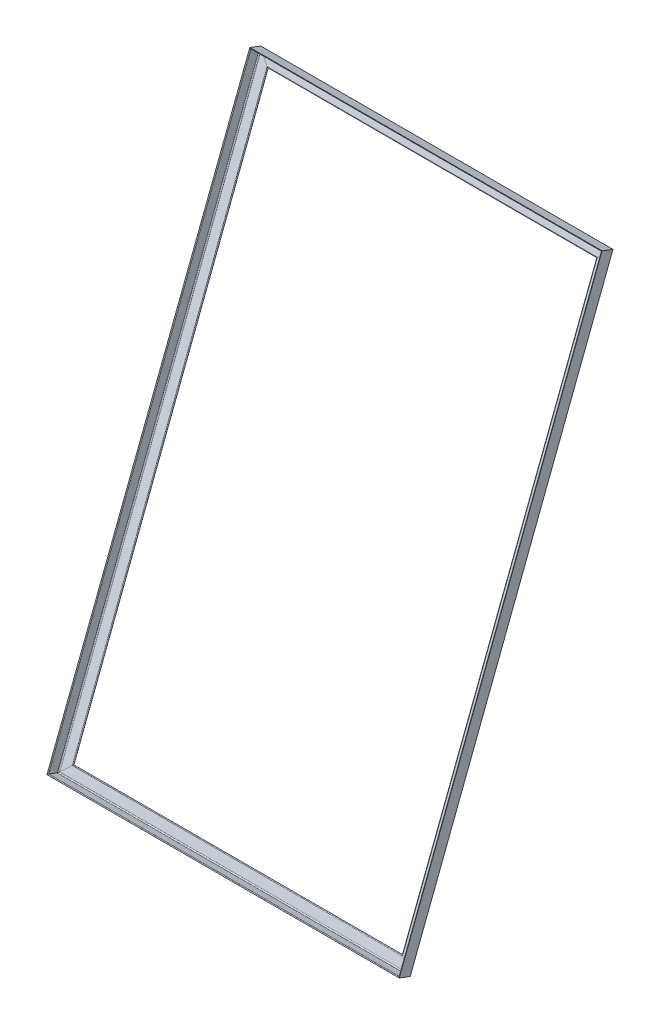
ISO-10303-21;
HEADER;
FILE_DESCRIPTION(('STEP AP214'),'2;1');
FILE_NAME('part.step','',(''),(''),'','','');
FILE_SCHEMA(('AUTOMOTIVE_DESIGN { 1 0 10303 214 1 1 1 1 }'));
ENDSEC;
DATA;
#1=APPLICATION_CONTEXT('core data for automotive mechanical design processes');
#2=APPLICATION_PROTOCOL_DEFINITION('international standard','automotive_design',2000,#1);
#3=PRODUCT_CONTEXT('',#1,'mechanical');
#4=PRODUCT('Part','Part','',(#3));
#5=PRODUCT_RELATED_PRODUCT_CATEGORY('part','',(#4));
#6=PRODUCT_DEFINITION_FORMATION('','',#4);
#7=PRODUCT_DEFINITION_CONTEXT('part definition',#1,'design');
#8=PRODUCT_DEFINITION('design','',#6,#7);
#9=PRODUCT_DEFINITION_SHAPE('','',#8);
#10=(LENGTH_UNIT() NAMED_UNIT(*) SI_UNIT(.MILLI.,.METRE.));
#11=(NAMED_UNIT(*) PLANE_ANGLE_UNIT() SI_UNIT($,.RADIAN.));
#12=(NAMED_UNIT(*) SI_UNIT($,.STERADIAN.) SOLID_ANGLE_UNIT());
#13=UNCERTAINTY_MEASURE_WITH_UNIT(LENGTH_MEASURE(1.E-05),#10,'distance_accuracy_value','');
#14=(GEOMETRIC_REPRESENTATION_CONTEXT(3) GLOBAL_UNCERTAINTY_ASSIGNED_CONTEXT((#13)) GLOBAL_UNIT_ASSIGNED_CONTEXT((#10,
#11,#12)) REPRESENTATION_CONTEXT('',''));
#15=CARTESIAN_POINT('',(0.,0.,0.));
#16=DIRECTION('',(0.,0.,1.));
#17=DIRECTION('',(1.,0.,0.));
#18=AXIS2_PLACEMENT_3D('',#15,#16,#17);
#19=CARTESIAN_POINT('',(50.8,2286.,877.519200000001));
#20=DIRECTION('',(0.,0.358370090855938,0.933579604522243));
#21=DIRECTION('',(0.,-0.933579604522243,0.358370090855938));
#22=AXIS2_PLACEMENT_3D('',#19,#20,#21);
#23=PLANE('',#22);
#24=DIRECTION('',(-0.707106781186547,0.660140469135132,-0.253405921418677));
#25=VECTOR('',#24,1.);
#26=CARTESIAN_POINT('',(1249.71980568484,3405.28707804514,447.862200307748));
#27=LINE('',#26,#25);
#28=CARTESIAN_POINT('',(50.7999999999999,4524.57415609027,18.2052006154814));
#29=VERTEX_POINT('',#28);
#30=CARTESIAN_POINT('',(0.,4572.,-6.10622663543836E-13));
#31=VERTEX_POINT('',#30);
#32=EDGE_CURVE('E154',#29,#31,#27,.T.);
#33=ORIENTED_EDGE('',*,*,#32,.F.);
#34=DIRECTION('',(0.,0.933579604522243,-0.358370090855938));
#35=VECTOR('',#34,1.);
#36=CARTESIAN_POINT('',(50.8,2286.,877.519200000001));
#37=LINE('',#36,#35);
#38=CARTESIAN_POINT('',(50.8000000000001,2333.42584390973,859.313999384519));
#39=VERTEX_POINT('',#38);
#40=EDGE_CURVE('E191',#39,#29,#37,.T.);
#41=ORIENTED_EDGE('',*,*,#40,.F.);
#42=DIRECTION('',(0.707106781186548,0.660140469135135,-0.253405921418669));
#43=VECTOR('',#42,1.);
#44=CARTESIAN_POINT('',(25.3999999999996,2309.71292195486,868.41659969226));
#45=LINE('',#44,#43);
#46=CARTESIAN_POINT('',(0.,2286.,877.5192));
#47=VERTEX_POINT('',#46);
#48=EDGE_CURVE('E145',#47,#39,#45,.T.);
#49=ORIENTED_EDGE('',*,*,#48,.F.);
#50=DIRECTION('',(0.,0.933579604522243,-0.358370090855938));
#51=VECTOR('',#50,1.);
#52=CARTESIAN_POINT('',(0.,2286.,877.519200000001));
#53=LINE('',#52,#51);
#54=EDGE_CURVE('E80',#47,#31,#53,.T.);
#55=ORIENTED_EDGE('',*,*,#54,.T.);
#56=EDGE_LOOP('',(#33,#41,#49,#55));
#57=FACE_BOUND('',#56,.T.);
#58=ADVANCED_FACE('F76',(#57),#23,.F.);
#59=CARTESIAN_POINT('',(50.8000000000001,2286.00182052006,877.523942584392));
#60=DIRECTION('',(-1.,0.,0.));
#61=DIRECTION('',(0.,0.,1.));
#62=AXIS2_PLACEMENT_3D('',#59,#60,#61);
#63=PLANE('',#62);
#64=DIRECTION('',(0.,-0.358370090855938,-0.933579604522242));
#65=VECTOR('',#64,1.);
#66=CARTESIAN_POINT('',(50.7999999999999,4524.57597661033,18.2099431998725));
#67=LINE('',#66,#65);
#68=CARTESIAN_POINT('',(50.7999999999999,4524.57597661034,18.2099431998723));
#69=VERTEX_POINT('',#68);
#70=EDGE_CURVE('E151',#69,#29,#67,.T.);
#71=ORIENTED_EDGE('',*,*,#70,.F.);
#72=DIRECTION('',(0.,0.933579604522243,-0.358370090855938));
#73=VECTOR('',#72,1.);
#74=CARTESIAN_POINT('',(50.8000000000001,2286.00182052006,877.523942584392));
#75=LINE('',#74,#73);
#76=CARTESIAN_POINT('',(50.8000000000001,2333.42766442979,859.31874196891));
#77=VERTEX_POINT('',#76);
#78=EDGE_CURVE('E189',#77,#69,#75,.T.);
#79=ORIENTED_EDGE('',*,*,#78,.F.);
#80=DIRECTION('',(0.,0.358370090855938,0.933579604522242));
#81=VECTOR('',#80,1.);
#82=CARTESIAN_POINT('',(50.8000000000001,2333.42766442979,859.31874196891));
#83=LINE('',#82,#81);
#84=EDGE_CURVE('E215',#39,#77,#83,.T.);
#85=ORIENTED_EDGE('',*,*,#84,.F.);
#86=ORIENTED_EDGE('',*,*,#40,.T.);
#87=EDGE_LOOP('',(#71,#79,#85,#86));
#88=FACE_BOUND('',#87,.T.);
#89=ADVANCED_FACE('F205',(#88),#63,.F.);
#90=CARTESIAN_POINT('',(47.6300800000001,2286.00182052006,877.523942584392));
#91=DIRECTION('',(0.,0.933579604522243,-0.358370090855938));
#92=DIRECTION('',(0.,0.358370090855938,0.933579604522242));
#93=AXIS2_PLACEMENT_3D('',#90,#91,#92);
#94=CYLINDRICAL_SURFACE('',#93,3.16991999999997);
#95=CARTESIAN_POINT('',(47.63008,4527.5353492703,17.0739386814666));
#96=DIRECTION('',(0.707106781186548,0.660140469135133,-0.253405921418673));
#97=DIRECTION('',(-0.707106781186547,0.660140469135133,-0.253405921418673));
#98=AXIS2_PLACEMENT_3D('',#95,#96,#97);
#99=ELLIPSE('',#98,4.48294385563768,3.16991999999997);
#100=CARTESIAN_POINT('',(47.6300800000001,4528.67135378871,20.0333113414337));
#101=VERTEX_POINT('',#100);
#102=EDGE_CURVE('E14',#101,#69,#99,.T.);
#103=ORIENTED_EDGE('',*,*,#102,.F.);
#104=DIRECTION('',(0.,0.933579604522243,-0.358370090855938));
#105=VECTOR('',#104,1.);
#106=CARTESIAN_POINT('',(47.6300800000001,2287.13782503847,880.483315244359));
#107=LINE('',#106,#105);
#108=CARTESIAN_POINT('',(47.6300799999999,2331.60429628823,863.414119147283));
#109=VERTEX_POINT('',#108);
#110=EDGE_CURVE('E186',#109,#101,#107,.T.);
#111=ORIENTED_EDGE('',*,*,#110,.F.);
#112=CARTESIAN_POINT('',(47.6300800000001,2330.46829176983,860.454746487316));
#113=DIRECTION('',(0.707106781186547,-0.660140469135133,0.253405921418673));
#114=DIRECTION('',(0.707106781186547,0.660140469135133,-0.253405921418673));
#115=AXIS2_PLACEMENT_3D('',#112,#113,#114);
#116=ELLIPSE('',#115,4.48294385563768,3.16991999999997);
#117=EDGE_CURVE('E212',#77,#109,#116,.T.);
#118=ORIENTED_EDGE('',*,*,#117,.F.);
#119=ORIENTED_EDGE('',*,*,#78,.T.);
#120=EDGE_LOOP('',(#103,#111,#118,#119));
#121=FACE_BOUND('',#120,.T.);
#122=ADVANCED_FACE('F209',(#121),#94,.T.);
#123=CARTESIAN_POINT('',(7.93750000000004,2287.13782503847,880.483315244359));
#124=DIRECTION('',(0.,-0.358370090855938,-0.933579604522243));
#125=DIRECTION('',(0.,0.933579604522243,-0.358370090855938));
#126=AXIS2_PLACEMENT_3D('',#123,#124,#125);
#127=PLANE('',#126);
#128=DIRECTION('',(0.707106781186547,-0.660140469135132,0.253405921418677));
#129=VECTOR('',#128,1.);
#130=CARTESIAN_POINT('',(1228.28855568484,3426.43268098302,443.14599654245));
#131=LINE('',#130,#129);
#132=CARTESIAN_POINT('',(7.9374999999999,4565.72753692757,5.80867784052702));
#133=VERTEX_POINT('',#132);
#134=EDGE_CURVE('E85',#133,#101,#131,.T.);
#135=ORIENTED_EDGE('',*,*,#134,.F.);
#136=DIRECTION('',(0.,0.933579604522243,-0.358370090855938));
#137=VECTOR('',#136,1.);
#138=CARTESIAN_POINT('',(7.93750000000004,2287.13782503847,880.483315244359));
#139=LINE('',#138,#137);
#140=CARTESIAN_POINT('',(7.93750000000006,2294.54811314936,877.638752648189));
#141=VERTEX_POINT('',#140);
#142=EDGE_CURVE('E183',#141,#133,#139,.T.);
#143=ORIENTED_EDGE('',*,*,#142,.F.);
#144=DIRECTION('',(-0.707106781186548,-0.660140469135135,0.253405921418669));
#145=VECTOR('',#144,1.);
#146=CARTESIAN_POINT('',(3.96874999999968,2290.84296909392,879.061033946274));
#147=LINE('',#146,#145);
#148=EDGE_CURVE('E214',#109,#141,#147,.T.);
#149=ORIENTED_EDGE('',*,*,#148,.F.);
#150=ORIENTED_EDGE('',*,*,#110,.T.);
#151=EDGE_LOOP('',(#135,#143,#149,#150));
#152=FACE_BOUND('',#151,.T.);
#153=ADVANCED_FACE('F256',(#152),#127,.F.);
#154=CARTESIAN_POINT('',(7.93750000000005,2288.84456259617,884.929488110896));
#155=DIRECTION('',(0.,0.933579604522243,-0.358370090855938));
#156=DIRECTION('',(0.,0.358370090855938,0.933579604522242));
#157=AXIS2_PLACEMENT_3D('',#154,#155,#156);
#158=CYLINDRICAL_SURFACE('',#157,4.76250000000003);
#159=CARTESIAN_POINT('',(7.93749999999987,4567.43427448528,10.2548507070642));
#160=DIRECTION('',(0.707106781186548,0.660140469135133,-0.253405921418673));
#161=DIRECTION('',(-0.707106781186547,0.660140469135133,-0.253405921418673));
#162=AXIS2_PLACEMENT_3D('',#159,#160,#161);
#163=ELLIPSE('',#162,6.73519209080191,4.76250000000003);
#164=CARTESIAN_POINT('',(3.17499999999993,4571.88044735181,8.54811314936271));
#165=VERTEX_POINT('',#164);
#166=EDGE_CURVE('E165',#165,#133,#163,.F.);
#167=ORIENTED_EDGE('',*,*,#166,.F.);
#168=DIRECTION('',(0.,0.933579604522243,-0.358370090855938));
#169=VECTOR('',#168,1.);
#170=CARTESIAN_POINT('',(3.17500000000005,2288.84456259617,884.929488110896));
#171=LINE('',#170,#169);
#172=CARTESIAN_POINT('',(3.17500000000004,2291.80867784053,883.791663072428));
#173=VERTEX_POINT('',#172);
#174=EDGE_CURVE('E180',#173,#165,#171,.T.);
#175=ORIENTED_EDGE('',*,*,#174,.F.);
#176=CARTESIAN_POINT('',(7.93750000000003,2296.25485070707,882.084925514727));
#177=DIRECTION('',(0.707106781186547,-0.660140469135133,0.253405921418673));
#178=DIRECTION('',(0.707106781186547,0.660140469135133,-0.253405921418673));
#179=AXIS2_PLACEMENT_3D('',#176,#177,#178);
#180=ELLIPSE('',#179,6.7351920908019,4.76250000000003);
#181=EDGE_CURVE('E217',#141,#173,#180,.F.);
#182=ORIENTED_EDGE('',*,*,#181,.F.);
#183=ORIENTED_EDGE('',*,*,#142,.T.);
#184=EDGE_LOOP('',(#167,#175,#182,#183));
#185=FACE_BOUND('',#184,.T.);
#186=ADVANCED_FACE('F230',(#185),#158,.F.);
#187=CARTESIAN_POINT('',(3.17499999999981,2303.06919609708,921.985671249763));
#188=DIRECTION('',(-1.,0.,0.));
#189=DIRECTION('',(0.,0.,1.));
#190=AXIS2_PLACEMENT_3D('',#187,#188,#189);
#191=PLANE('',#190);
#192=DIRECTION('',(0.,-0.358370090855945,-0.93357960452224));
#193=VECTOR('',#192,1.);
#194=CARTESIAN_POINT('',(3.17499999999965,4586.10508085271,45.6042962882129));
#195=LINE('',#194,#193);
#196=CARTESIAN_POINT('',(3.17499999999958,4586.10508085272,45.6042962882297));
#197=VERTEX_POINT('',#196);
#198=EDGE_CURVE('E168',#197,#165,#195,.T.);
#199=ORIENTED_EDGE('',*,*,#198,.F.);
#200=DIRECTION('',(0.,0.933579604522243,-0.358370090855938));
#201=VECTOR('',#200,1.);
#202=CARTESIAN_POINT('',(3.17499999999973,2303.06919609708,921.985671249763));
#203=LINE('',#202,#201);
#204=CARTESIAN_POINT('',(3.17499999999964,2306.03331134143,920.847846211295));
#205=VERTEX_POINT('',#204);
#206=EDGE_CURVE('E177',#205,#197,#203,.T.);
#207=ORIENTED_EDGE('',*,*,#206,.F.);
#208=DIRECTION('',(0.,0.358370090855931,0.933579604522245));
#209=VECTOR('',#208,1.);
#210=CARTESIAN_POINT('',(3.17499999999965,2306.03331134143,920.847846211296));
#211=LINE('',#210,#209);
#212=EDGE_CURVE('E156',#173,#205,#211,.T.);
#213=ORIENTED_EDGE('',*,*,#212,.F.);
#214=ORIENTED_EDGE('',*,*,#174,.T.);
#215=EDGE_LOOP('',(#199,#207,#213,#214));
#216=FACE_BOUND('',#215,.T.);
#217=ADVANCED_FACE('F227',(#216),#191,.F.);
#218=CARTESIAN_POINT('',(0.00507999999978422,2303.06919609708,921.985671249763));
#219=DIRECTION('',(0.,0.933579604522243,-0.358370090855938));
#220=DIRECTION('',(0.,0.358370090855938,0.933579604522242));
#221=AXIS2_PLACEMENT_3D('',#218,#219,#220);
#222=CYLINDRICAL_SURFACE('',#221,3.16991999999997);
#223=CARTESIAN_POINT('',(0.00507999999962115,4589.06445351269,44.4682917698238));
#224=DIRECTION('',(0.707106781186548,0.660140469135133,-0.253405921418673));
#225=DIRECTION('',(-0.707106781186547,0.660140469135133,-0.253405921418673));
#226=AXIS2_PLACEMENT_3D('',#223,#224,#225);
#227=ELLIPSE('',#226,4.48294385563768,3.16991999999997);
#228=CARTESIAN_POINT('',(0.00507999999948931,4590.20045803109,47.427664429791));
#229=VERTEX_POINT('',#228);
#230=EDGE_CURVE('E171',#229,#197,#227,.T.);
#231=ORIENTED_EDGE('',*,*,#230,.F.);
#232=DIRECTION('',(0.,0.933579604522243,-0.358370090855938));
#233=VECTOR('',#232,1.);
#234=CARTESIAN_POINT('',(0.00507999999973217,2304.20520061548,924.94504390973));
#235=LINE('',#234,#233);
#236=CARTESIAN_POINT('',(0.00507999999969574,2304.20994319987,924.943223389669));
#237=VERTEX_POINT('',#236);
#238=EDGE_CURVE('E139',#237,#229,#235,.T.);
#239=ORIENTED_EDGE('',*,*,#238,.F.);
#240=CARTESIAN_POINT('',(0.00507999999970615,2303.07393868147,921.983850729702));
#241=DIRECTION('',(0.707106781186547,-0.660140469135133,0.253405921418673));
#242=DIRECTION('',(0.707106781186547,0.660140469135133,-0.253405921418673));
#243=AXIS2_PLACEMENT_3D('',#240,#241,#242);
#244=ELLIPSE('',#243,4.48294385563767,3.16991999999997);
#245=EDGE_CURVE('E150',#205,#237,#244,.T.);
#246=ORIENTED_EDGE('',*,*,#245,.F.);
#247=ORIENTED_EDGE('',*,*,#206,.T.);
#248=EDGE_LOOP('',(#231,#239,#246,#247));
#249=FACE_BOUND('',#248,.T.);
#250=ADVANCED_FACE('F239',(#249),#222,.T.);
#251=CARTESIAN_POINT('',(-3.10515502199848E-13,2304.20520061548,924.94504390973));
#252=DIRECTION('',(0.,-0.358370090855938,-0.933579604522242));
#253=DIRECTION('',(0.,0.933579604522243,-0.358370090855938));
#254=AXIS2_PLACEMENT_3D('',#251,#252,#253);
#255=PLANE('',#254);
#256=DIRECTION('',(0.707106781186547,-0.660140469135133,0.253405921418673));
#257=VECTOR('',#256,1.);
#258=CARTESIAN_POINT('',(1224.31980568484,3447.20520061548,486.18544390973));
#259=LINE('',#258,#257);
#260=CARTESIAN_POINT('',(-4.35415592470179E-13,4590.20520061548,47.425843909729));
#261=VERTEX_POINT('',#260);
#262=EDGE_CURVE('E136',#261,#229,#259,.T.);
#263=ORIENTED_EDGE('',*,*,#262,.F.);
#264=DIRECTION('',(0.,0.933579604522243,-0.358370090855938));
#265=VECTOR('',#264,1.);
#266=CARTESIAN_POINT('',(-3.10515502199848E-13,2304.20520061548,924.94504390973));
#267=LINE('',#266,#265);
#268=CARTESIAN_POINT('',(-3.52148865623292E-13,2304.20520061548,924.94504390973));
#269=VERTEX_POINT('',#268);
#270=EDGE_CURVE('E93',#269,#261,#267,.T.);
#271=ORIENTED_EDGE('',*,*,#270,.F.);
#272=DIRECTION('',(-0.707106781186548,-0.660140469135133,0.253405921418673));
#273=VECTOR('',#272,1.);
#274=CARTESIAN_POINT('',(-5.06539254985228E-13,2304.20520061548,924.94504390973));
#275=LINE('',#274,#273);
#276=EDGE_CURVE('E133',#237,#269,#275,.T.);
#277=ORIENTED_EDGE('',*,*,#276,.F.);
#278=ORIENTED_EDGE('',*,*,#238,.T.);
#279=EDGE_LOOP('',(#263,#271,#277,#278));
#280=FACE_BOUND('',#279,.T.);
#281=ADVANCED_FACE('F130',(#280),#255,.F.);
#282=CARTESIAN_POINT('',(0.,2286.,877.519200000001));
#283=DIRECTION('',(1.,0.,0.));
#284=DIRECTION('',(0.,0.,-1.));
#285=AXIS2_PLACEMENT_3D('',#282,#283,#284);
#286=PLANE('',#285);
#287=DIRECTION('',(0.,0.358370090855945,0.93357960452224));
#288=VECTOR('',#287,1.);
#289=CARTESIAN_POINT('',(0.,4572.,-1.66533453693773E-11));
#290=LINE('',#289,#288);
#291=EDGE_CURVE('E161',#31,#261,#290,.T.);
#292=ORIENTED_EDGE('',*,*,#291,.F.);
#293=ORIENTED_EDGE('',*,*,#54,.F.);
#294=DIRECTION('',(0.,-0.358370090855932,-0.933579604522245));
#295=VECTOR('',#294,1.);
#296=CARTESIAN_POINT('',(0.,2286.,877.5192));
#297=LINE('',#296,#295);
#298=EDGE_CURVE('E138',#269,#47,#297,.T.);
#299=ORIENTED_EDGE('',*,*,#298,.F.);
#300=ORIENTED_EDGE('',*,*,#270,.T.);
#301=EDGE_LOOP('',(#292,#293,#299,#300));
#302=FACE_BOUND('',#301,.T.);
#303=ADVANCED_FACE('F142',(#302),#286,.F.);
#304=CARTESIAN_POINT('',(0.,2286.,877.519200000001));
#305=DIRECTION('',(0.707106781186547,-0.660140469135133,0.253405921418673));
#306=DIRECTION('',(0.68241445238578,0.730965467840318,0.));
#307=AXIS2_PLACEMENT_3D('',#304,#305,#306);
#308=PLANE('',#307);
#309=ORIENTED_EDGE('',*,*,#298,.T.);
#310=ORIENTED_EDGE('',*,*,#48,.T.);
#311=ORIENTED_EDGE('',*,*,#84,.T.);
#312=ORIENTED_EDGE('',*,*,#117,.T.);
#313=ORIENTED_EDGE('',*,*,#148,.T.);
#314=ORIENTED_EDGE('',*,*,#181,.T.);
#315=ORIENTED_EDGE('',*,*,#212,.T.);
#316=ORIENTED_EDGE('',*,*,#245,.T.);
#317=ORIENTED_EDGE('',*,*,#276,.T.);
#318=EDGE_LOOP('',(#309,#310,#311,#312,#313,#314,#315,#316,#317));
#319=FACE_BOUND('',#318,.T.);
#320=ADVANCED_FACE('F148',(#319),#308,.T.);
#321=CARTESIAN_POINT('',(0.,4572.,0.));
#322=DIRECTION('',(0.707106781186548,0.660140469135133,-0.253405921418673));
#323=DIRECTION('',(-0.68241445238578,0.730965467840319,0.));
#324=AXIS2_PLACEMENT_3D('',#321,#322,#323);
#325=PLANE('',#324);
#326=ORIENTED_EDGE('',*,*,#70,.T.);
#327=ORIENTED_EDGE('',*,*,#32,.T.);
#328=ORIENTED_EDGE('',*,*,#291,.T.);
#329=ORIENTED_EDGE('',*,*,#262,.T.);
#330=ORIENTED_EDGE('',*,*,#230,.T.);
#331=ORIENTED_EDGE('',*,*,#198,.T.);
#332=ORIENTED_EDGE('',*,*,#166,.T.);
#333=ORIENTED_EDGE('',*,*,#134,.T.);
#334=ORIENTED_EDGE('',*,*,#102,.T.);
#335=EDGE_LOOP('',(#326,#327,#328,#329,#330,#331,#332,#333,#334));
#336=FACE_BOUND('',#335,.T.);
#337=ADVANCED_FACE('F78',(#336),#325,.T.);
#338=CLOSED_SHELL('',(#58,#89,#122,#153,#186,#217,#250,#281,#303,#320,#337));
#339=MANIFOLD_SOLID_BREP('B2',#338);
#340=CARTESIAN_POINT('',(-1.55431223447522E-12,4524.57415609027,18.2052006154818));
#341=DIRECTION('',(0.,0.358370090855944,0.93357960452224));
#342=DIRECTION('',(0.,-0.933579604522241,0.358370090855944));
#343=AXIS2_PLACEMENT_3D('',#340,#341,#342);
#344=PLANE('',#343);
#345=DIRECTION('',(0.707106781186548,-0.660140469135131,0.253405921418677));
#346=VECTOR('',#345,1.);
#347=CARTESIAN_POINT('',(25.3999999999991,4548.28707804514,9.10260030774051));
#348=LINE('',#347,#346);
#349=CARTESIAN_POINT('',(0.,4572.,0.));
#350=VERTEX_POINT('',#349);
#351=CARTESIAN_POINT('',(50.8000000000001,4524.57415609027,18.2052006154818));
#352=VERTEX_POINT('',#351);
#353=EDGE_CURVE('E464',#350,#352,#348,.T.);
#354=ORIENTED_EDGE('',*,*,#353,.F.);
#355=DIRECTION('',(1.,0.,0.));
#356=VECTOR('',#355,1.);
#357=CARTESIAN_POINT('',(-1.55431223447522E-12,4572.,0.));
#358=LINE('',#357,#356);
#359=CARTESIAN_POINT('',(1524.,4572.,0.));
#360=VERTEX_POINT('',#359);
#361=EDGE_CURVE('E360',#350,#360,#358,.T.);
#362=ORIENTED_EDGE('',*,*,#361,.T.);
#363=DIRECTION('',(0.707106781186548,0.660140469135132,-0.253405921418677));
#364=VECTOR('',#363,1.);
#365=CARTESIAN_POINT('',(736.599999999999,3836.89941939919,282.18060953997));
#366=LINE('',#365,#364);
#367=CARTESIAN_POINT('',(1473.2,4524.57415609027,18.2052006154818));
#368=VERTEX_POINT('',#367);
#369=EDGE_CURVE('E485',#368,#360,#366,.T.);
#370=ORIENTED_EDGE('',*,*,#369,.F.);
#371=DIRECTION('',(1.,0.,0.));
#372=VECTOR('',#371,1.);
#373=CARTESIAN_POINT('',(-1.55431223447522E-12,4524.57415609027,18.2052006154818));
#374=LINE('',#373,#372);
#375=EDGE_CURVE('E479',#352,#368,#374,.T.);
#376=ORIENTED_EDGE('',*,*,#375,.F.);
#377=EDGE_LOOP('',(#354,#362,#370,#376));
#378=FACE_BOUND('',#377,.T.);
#379=ADVANCED_FACE('F356',(#378),#344,.F.);
#380=CARTESIAN_POINT('',(-6.66133814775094E-13,4524.57597661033,18.209943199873));
#381=DIRECTION('',(0.,0.933579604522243,-0.358370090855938));
#382=DIRECTION('',(0.,0.358370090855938,0.933579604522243));
#383=AXIS2_PLACEMENT_3D('',#380,#381,#382);
#384=PLANE('',#383);
#385=DIRECTION('',(0.,0.358370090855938,0.933579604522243));
#386=VECTOR('',#385,1.);
#387=CARTESIAN_POINT('',(50.8000000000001,4524.57597661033,18.209943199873));
#388=LINE('',#387,#386);
#389=CARTESIAN_POINT('',(50.8000000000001,4524.57597661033,18.209943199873));
#390=VERTEX_POINT('',#389);
#391=EDGE_CURVE('E419',#352,#390,#388,.T.);
#392=ORIENTED_EDGE('',*,*,#391,.F.);
#393=ORIENTED_EDGE('',*,*,#375,.T.);
#394=DIRECTION('',(0.,-0.358370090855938,-0.933579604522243));
#395=VECTOR('',#394,1.);
#396=CARTESIAN_POINT('',(1473.2,4524.57597661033,18.209943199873));
#397=LINE('',#396,#395);
#398=CARTESIAN_POINT('',(1473.2,4524.57597661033,18.209943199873));
#399=VERTEX_POINT('',#398);
#400=EDGE_CURVE('E471',#399,#368,#397,.T.);
#401=ORIENTED_EDGE('',*,*,#400,.F.);
#402=DIRECTION('',(1.,0.,0.));
#403=VECTOR('',#402,1.);
#404=CARTESIAN_POINT('',(-6.66133814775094E-13,4524.57597661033,18.209943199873));
#405=LINE('',#404,#403);
#406=EDGE_CURVE('E478',#390,#399,#405,.T.);
#407=ORIENTED_EDGE('',*,*,#406,.F.);
#408=EDGE_LOOP('',(#392,#393,#401,#407));
#409=FACE_BOUND('',#408,.T.);
#410=ADVANCED_FACE('F481',(#409),#384,.F.);
#411=CARTESIAN_POINT('',(-8.88178419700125E-13,4527.5353492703,17.0739386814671));
#412=DIRECTION('',(1.,0.,0.));
#413=DIRECTION('',(0.,0.,-1.));
#414=AXIS2_PLACEMENT_3D('',#411,#412,#413);
#415=CYLINDRICAL_SURFACE('',#414,3.16991999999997);
#416=CARTESIAN_POINT('',(47.6300800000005,4527.5353492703,17.0739386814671));
#417=DIRECTION('',(-0.707106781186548,-0.660140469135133,0.253405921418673));
#418=DIRECTION('',(0.707106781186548,-0.660140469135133,0.253405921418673));
#419=AXIS2_PLACEMENT_3D('',#416,#417,#418);
#420=ELLIPSE('',#419,4.48294385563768,3.16991999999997);
#421=CARTESIAN_POINT('',(47.6300799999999,4528.67135378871,20.0333113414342));
#422=VERTEX_POINT('',#421);
#423=EDGE_CURVE('E460',#390,#422,#420,.T.);
#424=ORIENTED_EDGE('',*,*,#423,.F.);
#425=ORIENTED_EDGE('',*,*,#406,.T.);
#426=CARTESIAN_POINT('',(1476.36992,4527.5353492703,17.0739386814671));
#427=DIRECTION('',(0.707106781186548,-0.660140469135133,0.253405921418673));
#428=DIRECTION('',(0.707106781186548,0.660140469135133,-0.253405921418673));
#429=AXIS2_PLACEMENT_3D('',#426,#427,#428);
#430=ELLIPSE('',#429,4.48294385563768,3.16991999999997);
#431=CARTESIAN_POINT('',(1476.36992,4528.67135378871,20.0333113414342));
#432=VERTEX_POINT('',#431);
#433=EDGE_CURVE('E469',#432,#399,#430,.T.);
#434=ORIENTED_EDGE('',*,*,#433,.F.);
#435=DIRECTION('',(1.,0.,0.));
#436=VECTOR('',#435,1.);
#437=CARTESIAN_POINT('',(-1.77635683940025E-12,4528.67135378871,20.0333113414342));
#438=LINE('',#437,#436);
#439=EDGE_CURVE('E476',#422,#432,#438,.T.);
#440=ORIENTED_EDGE('',*,*,#439,.F.);
#441=EDGE_LOOP('',(#424,#425,#434,#440));
#442=FACE_BOUND('',#441,.T.);
#443=ADVANCED_FACE('F522',(#442),#415,.T.);
#444=CARTESIAN_POINT('',(-1.77635683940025E-12,4565.72753692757,5.8086778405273));
#445=DIRECTION('',(0.,-0.358370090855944,-0.93357960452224));
#446=DIRECTION('',(0.,0.93357960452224,-0.358370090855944));
#447=AXIS2_PLACEMENT_3D('',#444,#445,#446);
#448=PLANE('',#447);
#449=DIRECTION('',(-0.707106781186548,0.660140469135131,-0.253405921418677));
#450=VECTOR('',#449,1.);
#451=CARTESIAN_POINT('',(3.96874999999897,4569.43268098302,4.3863965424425));
#452=LINE('',#451,#450);
#453=CARTESIAN_POINT('',(7.93749999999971,4565.72753692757,5.8086778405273));
#454=VERTEX_POINT('',#453);
#455=EDGE_CURVE('E456',#422,#454,#452,.T.);
#456=ORIENTED_EDGE('',*,*,#455,.F.);
#457=ORIENTED_EDGE('',*,*,#439,.T.);
#458=DIRECTION('',(-0.707106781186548,-0.660140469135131,0.253405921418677));
#459=VECTOR('',#458,1.);
#460=CARTESIAN_POINT('',(758.031249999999,3858.04502233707,277.464405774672));
#461=LINE('',#460,#459);
#462=CARTESIAN_POINT('',(1516.0625,4565.72753692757,5.8086778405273));
#463=VERTEX_POINT('',#462);
#464=EDGE_CURVE('E496',#463,#432,#461,.T.);
#465=ORIENTED_EDGE('',*,*,#464,.F.);
#466=DIRECTION('',(1.,0.,0.));
#467=VECTOR('',#466,1.);
#468=CARTESIAN_POINT('',(-1.77635683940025E-12,4565.72753692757,5.8086778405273));
#469=LINE('',#468,#467);
#470=EDGE_CURVE('E474',#454,#463,#469,.T.);
#471=ORIENTED_EDGE('',*,*,#470,.F.);
#472=EDGE_LOOP('',(#456,#457,#465,#471));
#473=FACE_BOUND('',#472,.T.);
#474=ADVANCED_FACE('F527',(#473),#448,.F.);
#475=CARTESIAN_POINT('',(-1.55431223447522E-12,4567.43427448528,10.2548507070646));
#476=DIRECTION('',(1.,0.,0.));
#477=DIRECTION('',(0.,0.,-1.));
#478=AXIS2_PLACEMENT_3D('',#475,#476,#477);
#479=CYLINDRICAL_SURFACE('',#478,4.76250000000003);
#480=CARTESIAN_POINT('',(7.9375000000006,4567.43427448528,10.2548507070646));
#481=DIRECTION('',(-0.707106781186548,-0.660140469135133,0.253405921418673));
#482=DIRECTION('',(0.707106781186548,-0.660140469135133,0.253405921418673));
#483=AXIS2_PLACEMENT_3D('',#480,#481,#482);
#484=ELLIPSE('',#483,6.7351920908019,4.76250000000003);
#485=CARTESIAN_POINT('',(3.17500000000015,4571.88044735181,8.54811314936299));
#486=VERTEX_POINT('',#485);
#487=EDGE_CURVE('E454',#454,#486,#484,.F.);
#488=ORIENTED_EDGE('',*,*,#487,.F.);
#489=ORIENTED_EDGE('',*,*,#470,.T.);
#490=CARTESIAN_POINT('',(1516.0625,4567.43427448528,10.2548507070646));
#491=DIRECTION('',(0.707106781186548,-0.660140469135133,0.253405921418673));
#492=DIRECTION('',(0.707106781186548,0.660140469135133,-0.253405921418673));
#493=AXIS2_PLACEMENT_3D('',#490,#491,#492);
#494=ELLIPSE('',#493,6.73519209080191,4.76250000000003);
#495=CARTESIAN_POINT('',(1520.825,4571.88044735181,8.54811314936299));
#496=VERTEX_POINT('',#495);
#497=EDGE_CURVE('E498',#496,#463,#494,.F.);
#498=ORIENTED_EDGE('',*,*,#497,.F.);
#499=DIRECTION('',(1.,0.,0.));
#500=VECTOR('',#499,1.);
#501=CARTESIAN_POINT('',(-1.77635683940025E-12,4571.88044735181,8.54811314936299));
#502=LINE('',#501,#500);
#503=EDGE_CURVE('E449',#486,#496,#502,.T.);
#504=ORIENTED_EDGE('',*,*,#503,.F.);
#505=EDGE_LOOP('',(#488,#489,#498,#504));
#506=FACE_BOUND('',#505,.T.);
#507=ADVANCED_FACE('F531',(#506),#479,.F.);
#508=CARTESIAN_POINT('',(-1.55431223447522E-12,4586.10508085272,45.6042962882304));
#509=DIRECTION('',(0.,0.93357960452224,-0.358370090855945));
#510=DIRECTION('',(0.,0.358370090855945,0.93357960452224));
#511=AXIS2_PLACEMENT_3D('',#508,#509,#510);
#512=PLANE('',#511);
#513=DIRECTION('',(0.,0.358370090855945,0.93357960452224));
#514=VECTOR('',#513,1.);
#515=CARTESIAN_POINT('',(3.17500000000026,4586.10508085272,45.6042962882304));
#516=LINE('',#515,#514);
#517=CARTESIAN_POINT('',(3.17500000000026,4586.10508085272,45.6042962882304));
#518=VERTEX_POINT('',#517);
#519=EDGE_CURVE('E441',#486,#518,#516,.T.);
#520=ORIENTED_EDGE('',*,*,#519,.F.);
#521=ORIENTED_EDGE('',*,*,#503,.T.);
#522=DIRECTION('',(0.,-0.358370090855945,-0.93357960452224));
#523=VECTOR('',#522,1.);
#524=CARTESIAN_POINT('',(1520.825,4586.10508085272,45.6042962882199));
#525=LINE('',#524,#523);
#526=CARTESIAN_POINT('',(1520.825,4586.10508085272,45.6042962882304));
#527=VERTEX_POINT('',#526);
#528=EDGE_CURVE('E447',#527,#496,#525,.T.);
#529=ORIENTED_EDGE('',*,*,#528,.F.);
#530=DIRECTION('',(1.,0.,0.));
#531=VECTOR('',#530,1.);
#532=CARTESIAN_POINT('',(-1.55431223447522E-12,4586.10508085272,45.6042962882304));
#533=LINE('',#532,#531);
#534=EDGE_CURVE('E436',#518,#527,#533,.T.);
#535=ORIENTED_EDGE('',*,*,#534,.F.);
#536=EDGE_LOOP('',(#520,#521,#529,#535));
#537=FACE_BOUND('',#536,.T.);
#538=ADVANCED_FACE('F444',(#537),#512,.F.);
#539=CARTESIAN_POINT('',(-1.66533453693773E-12,4589.06445351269,44.4682917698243));
#540=DIRECTION('',(1.,0.,0.));
#541=DIRECTION('',(0.,0.,-1.));
#542=AXIS2_PLACEMENT_3D('',#539,#540,#541);
#543=CYLINDRICAL_SURFACE('',#542,3.16991999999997);
#544=CARTESIAN_POINT('',(0.0050799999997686,4589.06445351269,44.4682917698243));
#545=DIRECTION('',(-0.707106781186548,-0.660140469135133,0.253405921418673));
#546=DIRECTION('',(0.707106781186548,-0.660140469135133,0.253405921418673));
#547=AXIS2_PLACEMENT_3D('',#544,#545,#546);
#548=ELLIPSE('',#547,4.48294385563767,3.16991999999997);
#549=CARTESIAN_POINT('',(0.00508000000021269,4590.20045803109,47.4276644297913));
#550=VERTEX_POINT('',#549);
#551=EDGE_CURVE('E365',#518,#550,#548,.T.);
#552=ORIENTED_EDGE('',*,*,#551,.F.);
#553=ORIENTED_EDGE('',*,*,#534,.T.);
#554=CARTESIAN_POINT('',(1523.99492,4589.06445351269,44.4682917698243));
#555=DIRECTION('',(0.707106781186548,-0.660140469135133,0.253405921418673));
#556=DIRECTION('',(0.707106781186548,0.660140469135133,-0.253405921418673));
#557=AXIS2_PLACEMENT_3D('',#554,#555,#556);
#558=ELLIPSE('',#557,4.48294385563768,3.16991999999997);
#559=CARTESIAN_POINT('',(1523.99492,4590.20045803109,47.4276644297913));
#560=VERTEX_POINT('',#559);
#561=EDGE_CURVE('E502',#560,#527,#558,.T.);
#562=ORIENTED_EDGE('',*,*,#561,.F.);
#563=DIRECTION('',(1.,0.,0.));
#564=VECTOR('',#563,1.);
#565=CARTESIAN_POINT('',(-1.55431223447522E-12,4590.20045803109,47.4276644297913));
#566=LINE('',#565,#564);
#567=EDGE_CURVE('E438',#550,#560,#566,.T.);
#568=ORIENTED_EDGE('',*,*,#567,.F.);
#569=EDGE_LOOP('',(#552,#553,#562,#568));
#570=FACE_BOUND('',#569,.T.);
#571=ADVANCED_FACE('F434',(#570),#543,.T.);
#572=CARTESIAN_POINT('',(-1.55431223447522E-12,4590.20520061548,47.4258439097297));
#573=DIRECTION('',(0.,-0.358370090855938,-0.933579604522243));
#574=DIRECTION('',(0.,0.933579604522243,-0.358370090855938));
#575=AXIS2_PLACEMENT_3D('',#572,#573,#574);
#576=PLANE('',#575);
#577=DIRECTION('',(-0.707106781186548,0.660140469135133,-0.253405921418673));
#578=VECTOR('',#577,1.);
#579=CARTESIAN_POINT('',(-7.7715611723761E-13,4590.20520061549,47.4258439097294));
#580=LINE('',#579,#578);
#581=CARTESIAN_POINT('',(-2.22044604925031E-13,4590.20520061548,47.4258439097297));
#582=VERTEX_POINT('',#581);
#583=EDGE_CURVE('E74',#550,#582,#580,.T.);
#584=ORIENTED_EDGE('',*,*,#583,.F.);
#585=ORIENTED_EDGE('',*,*,#567,.T.);
#586=DIRECTION('',(-0.707106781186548,-0.660140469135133,0.253405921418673));
#587=VECTOR('',#586,1.);
#588=CARTESIAN_POINT('',(761.999999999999,3878.81754196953,320.503853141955));
#589=LINE('',#588,#587);
#590=CARTESIAN_POINT('',(1524.,4590.20520061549,47.4258439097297));
#591=VERTEX_POINT('',#590);
#592=EDGE_CURVE('E504',#591,#560,#589,.T.);
#593=ORIENTED_EDGE('',*,*,#592,.F.);
#594=DIRECTION('',(1.,0.,0.));
#595=VECTOR('',#594,1.);
#596=CARTESIAN_POINT('',(-1.55431223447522E-12,4590.20520061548,47.4258439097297));
#597=LINE('',#596,#595);
#598=EDGE_CURVE('E378',#582,#591,#597,.T.);
#599=ORIENTED_EDGE('',*,*,#598,.F.);
#600=EDGE_LOOP('',(#584,#585,#593,#599));
#601=FACE_BOUND('',#600,.T.);
#602=ADVANCED_FACE('F509',(#601),#576,.F.);
#603=CARTESIAN_POINT('',(-1.55431223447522E-12,4572.,0.));
#604=DIRECTION('',(0.,-0.93357960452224,0.358370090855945));
#605=DIRECTION('',(0.,-0.358370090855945,-0.93357960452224));
#606=AXIS2_PLACEMENT_3D('',#603,#604,#605);
#607=PLANE('',#606);
#608=DIRECTION('',(0.,-0.358370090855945,-0.93357960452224));
#609=VECTOR('',#608,1.);
#610=CARTESIAN_POINT('',(0.,4572.,0.));
#611=LINE('',#610,#609);
#612=EDGE_CURVE('E467',#582,#350,#611,.T.);
#613=ORIENTED_EDGE('',*,*,#612,.F.);
#614=ORIENTED_EDGE('',*,*,#598,.T.);
#615=DIRECTION('',(0.,0.358370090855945,0.93357960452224));
#616=VECTOR('',#615,1.);
#617=CARTESIAN_POINT('',(1524.,4572.,-9.99547666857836E-12));
#618=LINE('',#617,#616);
#619=EDGE_CURVE('E488',#360,#591,#618,.T.);
#620=ORIENTED_EDGE('',*,*,#619,.F.);
#621=ORIENTED_EDGE('',*,*,#361,.F.);
#622=EDGE_LOOP('',(#613,#614,#620,#621));
#623=FACE_BOUND('',#622,.T.);
#624=ADVANCED_FACE('F507',(#623),#607,.F.);
#625=CARTESIAN_POINT('',(1524.,4572.,0.));
#626=DIRECTION('',(0.707106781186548,-0.660140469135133,0.253405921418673));
#627=DIRECTION('',(0.682414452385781,0.730965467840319,0.));
#628=AXIS2_PLACEMENT_3D('',#625,#626,#627);
#629=PLANE('',#628);
#630=ORIENTED_EDGE('',*,*,#400,.T.);
#631=ORIENTED_EDGE('',*,*,#369,.T.);
#632=ORIENTED_EDGE('',*,*,#619,.T.);
#633=ORIENTED_EDGE('',*,*,#592,.T.);
#634=ORIENTED_EDGE('',*,*,#561,.T.);
#635=ORIENTED_EDGE('',*,*,#528,.T.);
#636=ORIENTED_EDGE('',*,*,#497,.T.);
#637=ORIENTED_EDGE('',*,*,#464,.T.);
#638=ORIENTED_EDGE('',*,*,#433,.T.);
#639=EDGE_LOOP('',(#630,#631,#632,#633,#634,#635,#636,#637,#638));
#640=FACE_BOUND('',#639,.T.);
#641=ADVANCED_FACE('F490',(#640),#629,.T.);
#642=CARTESIAN_POINT('',(0.,4572.,0.));
#643=DIRECTION('',(-0.707106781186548,-0.660140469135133,0.253405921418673));
#644=DIRECTION('',(0.68241445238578,-0.730965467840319,0.));
#645=AXIS2_PLACEMENT_3D('',#642,#643,#644);
#646=PLANE('',#645);
#647=ORIENTED_EDGE('',*,*,#612,.T.);
#648=ORIENTED_EDGE('',*,*,#353,.T.);
#649=ORIENTED_EDGE('',*,*,#391,.T.);
#650=ORIENTED_EDGE('',*,*,#423,.T.);
#651=ORIENTED_EDGE('',*,*,#455,.T.);
#652=ORIENTED_EDGE('',*,*,#487,.T.);
#653=ORIENTED_EDGE('',*,*,#519,.T.);
#654=ORIENTED_EDGE('',*,*,#551,.T.);
#655=ORIENTED_EDGE('',*,*,#583,.T.);
#656=EDGE_LOOP('',(#647,#648,#649,#650,#651,#652,#653,#654,#655));
#657=FACE_BOUND('',#656,.T.);
#658=ADVANCED_FACE('F358',(#657),#646,.T.);
#659=CLOSED_SHELL('',(#379,#410,#443,#474,#507,#538,#571,#602,#624,#641,#658));
#660=MANIFOLD_SOLID_BREP('B8',#659);
#661=CARTESIAN_POINT('',(1524.,2333.42584390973,859.313999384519));
#662=DIRECTION('',(0.,0.358370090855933,0.933579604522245));
#663=DIRECTION('',(0.,-0.933579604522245,0.358370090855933));
#664=AXIS2_PLACEMENT_3D('',#661,#662,#663);
#665=PLANE('',#664);
#666=DIRECTION('',(-0.707106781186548,-0.660140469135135,0.253405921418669));
#667=VECTOR('',#666,1.);
#668=CARTESIAN_POINT('',(787.400000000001,3021.10058060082,595.338590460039));
#669=LINE('',#668,#667);
#670=CARTESIAN_POINT('',(50.7999999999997,2333.42584390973,859.313999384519));
#671=VERTEX_POINT('',#670);
#672=CARTESIAN_POINT('',(-4.44089209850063E-13,2286.,877.5192));
#673=VERTEX_POINT('',#672);
#674=EDGE_CURVE('E713',#671,#673,#669,.T.);
#675=ORIENTED_EDGE('',*,*,#674,.F.);
#676=DIRECTION('',(-1.,0.,0.));
#677=VECTOR('',#676,1.);
#678=CARTESIAN_POINT('',(1524.,2333.42584390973,859.313999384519));
#679=LINE('',#678,#677);
#680=CARTESIAN_POINT('',(1473.2,2333.42584390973,859.313999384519));
#681=VERTEX_POINT('',#680);
#682=EDGE_CURVE('E750',#681,#671,#679,.T.);
#683=ORIENTED_EDGE('',*,*,#682,.F.);
#684=DIRECTION('',(-0.707106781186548,0.660140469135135,-0.253405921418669));
#685=VECTOR('',#684,1.);
#686=CARTESIAN_POINT('',(1498.6,2309.71292195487,868.41659969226));
#687=LINE('',#686,#685);
#688=CARTESIAN_POINT('',(1524.,2286.,877.5192));
#689=VERTEX_POINT('',#688);
#690=EDGE_CURVE('E704',#689,#681,#687,.T.);
#691=ORIENTED_EDGE('',*,*,#690,.F.);
#692=DIRECTION('',(-1.,0.,0.));
#693=VECTOR('',#692,1.);
#694=CARTESIAN_POINT('',(1524.,2286.,877.5192));
#695=LINE('',#694,#693);
#696=EDGE_CURVE('E639',#689,#673,#695,.T.);
#697=ORIENTED_EDGE('',*,*,#696,.T.);
#698=EDGE_LOOP('',(#675,#683,#691,#697));
#699=FACE_BOUND('',#698,.T.);
#700=ADVANCED_FACE('F635',(#699),#665,.F.);
#701=CARTESIAN_POINT('',(1524.,2333.42766442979,859.31874196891));
#702=DIRECTION('',(0.,-0.933579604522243,0.358370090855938));
#703=DIRECTION('',(0.,-0.358370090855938,-0.933579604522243));
#704=AXIS2_PLACEMENT_3D('',#701,#702,#703);
#705=PLANE('',#704);
#706=DIRECTION('',(0.,-0.358370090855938,-0.933579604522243));
#707=VECTOR('',#706,1.);
#708=CARTESIAN_POINT('',(50.7999999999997,2333.42766442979,859.31874196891));
#709=LINE('',#708,#707);
#710=CARTESIAN_POINT('',(50.8,2333.42766442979,859.31874196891));
#711=VERTEX_POINT('',#710);
#712=EDGE_CURVE('E710',#711,#671,#709,.T.);
#713=ORIENTED_EDGE('',*,*,#712,.F.);
#714=DIRECTION('',(-1.,0.,0.));
#715=VECTOR('',#714,1.);
#716=CARTESIAN_POINT('',(1524.,2333.42766442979,859.31874196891));
#717=LINE('',#716,#715);
#718=CARTESIAN_POINT('',(1473.2,2333.42766442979,859.31874196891));
#719=VERTEX_POINT('',#718);
#720=EDGE_CURVE('E748',#719,#711,#717,.T.);
#721=ORIENTED_EDGE('',*,*,#720,.F.);
#722=DIRECTION('',(0.,0.358370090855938,0.933579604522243));
#723=VECTOR('',#722,1.);
#724=CARTESIAN_POINT('',(1473.2,2333.42766442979,859.31874196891));
#725=LINE('',#724,#723);
#726=EDGE_CURVE('E774',#681,#719,#725,.T.);
#727=ORIENTED_EDGE('',*,*,#726,.F.);
#728=ORIENTED_EDGE('',*,*,#682,.T.);
#729=EDGE_LOOP('',(#713,#721,#727,#728));
#730=FACE_BOUND('',#729,.T.);
#731=ADVANCED_FACE('F764',(#730),#705,.F.);
#732=CARTESIAN_POINT('',(1524.,2330.46829176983,860.454746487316));
#733=DIRECTION('',(-1.,0.,0.));
#734=DIRECTION('',(0.,0.,1.));
#735=AXIS2_PLACEMENT_3D('',#732,#733,#734);
#736=CYLINDRICAL_SURFACE('',#735,3.16991999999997);
#737=CARTESIAN_POINT('',(47.6300800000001,2330.46829176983,860.454746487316));
#738=DIRECTION('',(-0.707106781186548,0.660140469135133,-0.253405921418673));
#739=DIRECTION('',(-0.707106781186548,-0.660140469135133,0.253405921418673));
#740=AXIS2_PLACEMENT_3D('',#737,#738,#739);
#741=ELLIPSE('',#740,4.48294385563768,3.16991999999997);
#742=CARTESIAN_POINT('',(47.6300799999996,2331.60429628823,863.414119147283));
#743=VERTEX_POINT('',#742);
#744=EDGE_CURVE('E354',#743,#711,#741,.T.);
#745=ORIENTED_EDGE('',*,*,#744,.F.);
#746=DIRECTION('',(-1.,0.,0.));
#747=VECTOR('',#746,1.);
#748=CARTESIAN_POINT('',(1524.,2331.60429628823,863.414119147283));
#749=LINE('',#748,#747);
#750=CARTESIAN_POINT('',(1476.36992,2331.60429628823,863.414119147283));
#751=VERTEX_POINT('',#750);
#752=EDGE_CURVE('E745',#751,#743,#749,.T.);
#753=ORIENTED_EDGE('',*,*,#752,.F.);
#754=CARTESIAN_POINT('',(1476.36992,2330.46829176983,860.454746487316));
#755=DIRECTION('',(0.707106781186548,0.660140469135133,-0.253405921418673));
#756=DIRECTION('',(-0.707106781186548,0.660140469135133,-0.253405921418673));
#757=AXIS2_PLACEMENT_3D('',#754,#755,#756);
#758=ELLIPSE('',#757,4.48294385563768,3.16991999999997);
#759=EDGE_CURVE('E771',#719,#751,#758,.T.);
#760=ORIENTED_EDGE('',*,*,#759,.F.);
#761=ORIENTED_EDGE('',*,*,#720,.T.);
#762=EDGE_LOOP('',(#745,#753,#760,#761));
#763=FACE_BOUND('',#762,.T.);
#764=ADVANCED_FACE('F768',(#763),#736,.T.);
#765=CARTESIAN_POINT('',(1524.,2294.54811314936,877.638752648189));
#766=DIRECTION('',(0.,-0.358370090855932,-0.933579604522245));
#767=DIRECTION('',(0.,0.933579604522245,-0.358370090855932));
#768=AXIS2_PLACEMENT_3D('',#765,#766,#767);
#769=PLANE('',#768);
#770=DIRECTION('',(0.707106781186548,0.660140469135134,-0.253405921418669));
#771=VECTOR('',#770,1.);
#772=CARTESIAN_POINT('',(765.96875,3002.23062773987,605.983024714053));
#773=LINE('',#772,#771);
#774=CARTESIAN_POINT('',(7.93749999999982,2294.54811314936,877.638752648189));
#775=VERTEX_POINT('',#774);
#776=EDGE_CURVE('E644',#775,#743,#773,.T.);
#777=ORIENTED_EDGE('',*,*,#776,.F.);
#778=DIRECTION('',(-1.,0.,0.));
#779=VECTOR('',#778,1.);
#780=CARTESIAN_POINT('',(1524.,2294.54811314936,877.638752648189));
#781=LINE('',#780,#779);
#782=CARTESIAN_POINT('',(1516.0625,2294.54811314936,877.638752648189));
#783=VERTEX_POINT('',#782);
#784=EDGE_CURVE('E742',#783,#775,#781,.T.);
#785=ORIENTED_EDGE('',*,*,#784,.F.);
#786=DIRECTION('',(0.707106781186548,-0.660140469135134,0.253405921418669));
#787=VECTOR('',#786,1.);
#788=CARTESIAN_POINT('',(1520.03125,2290.84296909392,879.061033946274));
#789=LINE('',#788,#787);
#790=EDGE_CURVE('E773',#751,#783,#789,.T.);
#791=ORIENTED_EDGE('',*,*,#790,.F.);
#792=ORIENTED_EDGE('',*,*,#752,.T.);
#793=EDGE_LOOP('',(#777,#785,#791,#792));
#794=FACE_BOUND('',#793,.T.);
#795=ADVANCED_FACE('F815',(#794),#769,.F.);
#796=CARTESIAN_POINT('',(1524.,2296.25485070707,882.084925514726));
#797=DIRECTION('',(-1.,0.,0.));
#798=DIRECTION('',(0.,0.,1.));
#799=AXIS2_PLACEMENT_3D('',#796,#797,#798);
#800=CYLINDRICAL_SURFACE('',#799,4.76250000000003);
#801=CARTESIAN_POINT('',(7.9374999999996,2296.25485070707,882.084925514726));
#802=DIRECTION('',(-0.707106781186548,0.660140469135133,-0.253405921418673));
#803=DIRECTION('',(-0.707106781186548,-0.660140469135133,0.253405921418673));
#804=AXIS2_PLACEMENT_3D('',#801,#802,#803);
#805=ELLIPSE('',#804,6.73519209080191,4.76250000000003);
#806=CARTESIAN_POINT('',(3.17499999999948,2291.80867784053,883.791663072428));
#807=VERTEX_POINT('',#806);
#808=EDGE_CURVE('E724',#807,#775,#805,.F.);
#809=ORIENTED_EDGE('',*,*,#808,.F.);
#810=DIRECTION('',(-1.,0.,0.));
#811=VECTOR('',#810,1.);
#812=CARTESIAN_POINT('',(1524.,2291.80867784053,883.791663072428));
#813=LINE('',#812,#811);
#814=CARTESIAN_POINT('',(1520.825,2291.80867784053,883.791663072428));
#815=VERTEX_POINT('',#814);
#816=EDGE_CURVE('E739',#815,#807,#813,.T.);
#817=ORIENTED_EDGE('',*,*,#816,.F.);
#818=CARTESIAN_POINT('',(1516.0625,2296.25485070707,882.084925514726));
#819=DIRECTION('',(0.707106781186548,0.660140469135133,-0.253405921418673));
#820=DIRECTION('',(-0.707106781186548,0.660140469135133,-0.253405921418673));
#821=AXIS2_PLACEMENT_3D('',#818,#819,#820);
#822=ELLIPSE('',#821,6.73519209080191,4.76250000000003);
#823=EDGE_CURVE('E776',#783,#815,#822,.F.);
#824=ORIENTED_EDGE('',*,*,#823,.F.);
#825=ORIENTED_EDGE('',*,*,#784,.T.);
#826=EDGE_LOOP('',(#809,#817,#824,#825));
#827=FACE_BOUND('',#826,.T.);
#828=ADVANCED_FACE('F789',(#827),#800,.F.);
#829=CARTESIAN_POINT('',(1524.,2306.03331134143,920.847846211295));
#830=DIRECTION('',(0.,-0.933579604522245,0.358370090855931));
#831=DIRECTION('',(0.,-0.358370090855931,-0.933579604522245));
#832=AXIS2_PLACEMENT_3D('',#829,#830,#831);
#833=PLANE('',#832);
#834=DIRECTION('',(0.,-0.358370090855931,-0.933579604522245));
#835=VECTOR('',#834,1.);
#836=CARTESIAN_POINT('',(3.17499999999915,2306.03331134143,920.847846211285));
#837=LINE('',#836,#835);
#838=CARTESIAN_POINT('',(3.17499999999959,2306.03331134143,920.847846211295));
#839=VERTEX_POINT('',#838);
#840=EDGE_CURVE('E727',#839,#807,#837,.T.);
#841=ORIENTED_EDGE('',*,*,#840,.F.);
#842=DIRECTION('',(-1.,0.,0.));
#843=VECTOR('',#842,1.);
#844=CARTESIAN_POINT('',(1524.,2306.03331134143,920.847846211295));
#845=LINE('',#844,#843);
#846=CARTESIAN_POINT('',(1520.825,2306.03331134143,920.847846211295));
#847=VERTEX_POINT('',#846);
#848=EDGE_CURVE('E736',#847,#839,#845,.T.);
#849=ORIENTED_EDGE('',*,*,#848,.F.);
#850=DIRECTION('',(0.,0.358370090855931,0.933579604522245));
#851=VECTOR('',#850,1.);
#852=CARTESIAN_POINT('',(1520.825,2306.03331134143,920.847846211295));
#853=LINE('',#852,#851);
#854=EDGE_CURVE('E715',#815,#847,#853,.T.);
#855=ORIENTED_EDGE('',*,*,#854,.F.);
#856=ORIENTED_EDGE('',*,*,#816,.T.);
#857=EDGE_LOOP('',(#841,#849,#855,#856));
#858=FACE_BOUND('',#857,.T.);
#859=ADVANCED_FACE('F786',(#858),#833,.F.);
#860=CARTESIAN_POINT('',(1524.,2303.07393868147,921.983850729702));
#861=DIRECTION('',(-1.,0.,0.));
#862=DIRECTION('',(0.,0.,1.));
#863=AXIS2_PLACEMENT_3D('',#860,#861,#862);
#864=CYLINDRICAL_SURFACE('',#863,3.16991999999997);
#865=CARTESIAN_POINT('',(0.0050799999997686,2303.07393868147,921.983850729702));
#866=DIRECTION('',(-0.707106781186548,0.660140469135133,-0.253405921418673));
#867=DIRECTION('',(-0.707106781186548,-0.660140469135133,0.253405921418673));
#868=AXIS2_PLACEMENT_3D('',#865,#866,#867);
#869=ELLIPSE('',#868,4.48294385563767,3.16991999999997);
#870=CARTESIAN_POINT('',(0.00507999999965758,2304.20994319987,924.943223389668));
#871=VERTEX_POINT('',#870);
#872=EDGE_CURVE('E730',#871,#839,#869,.T.);
#873=ORIENTED_EDGE('',*,*,#872,.F.);
#874=DIRECTION('',(-1.,0.,0.));
#875=VECTOR('',#874,1.);
#876=CARTESIAN_POINT('',(1524.,2304.20994319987,924.943223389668));
#877=LINE('',#876,#875);
#878=CARTESIAN_POINT('',(1523.99492,2304.20994319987,924.943223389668));
#879=VERTEX_POINT('',#878);
#880=EDGE_CURVE('E698',#879,#871,#877,.T.);
#881=ORIENTED_EDGE('',*,*,#880,.F.);
#882=CARTESIAN_POINT('',(1523.99492,2303.07393868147,921.983850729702));
#883=DIRECTION('',(0.707106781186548,0.660140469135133,-0.253405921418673));
#884=DIRECTION('',(-0.707106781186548,0.660140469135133,-0.253405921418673));
#885=AXIS2_PLACEMENT_3D('',#882,#883,#884);
#886=ELLIPSE('',#885,4.48294385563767,3.16991999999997);
#887=EDGE_CURVE('E709',#847,#879,#886,.T.);
#888=ORIENTED_EDGE('',*,*,#887,.F.);
#889=ORIENTED_EDGE('',*,*,#848,.T.);
#890=EDGE_LOOP('',(#873,#881,#888,#889));
#891=FACE_BOUND('',#890,.T.);
#892=ADVANCED_FACE('F798',(#891),#864,.T.);
#893=CARTESIAN_POINT('',(1524.,2304.20520061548,924.94504390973));
#894=DIRECTION('',(0.,-0.358370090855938,-0.933579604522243));
#895=DIRECTION('',(0.,0.933579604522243,-0.358370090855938));
#896=AXIS2_PLACEMENT_3D('',#893,#894,#895);
#897=PLANE('',#896);
#898=DIRECTION('',(0.707106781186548,0.660140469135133,-0.253405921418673));
#899=VECTOR('',#898,1.);
#900=CARTESIAN_POINT('',(762.,3015.59285926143,651.867034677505));
#901=LINE('',#900,#899);
#902=CARTESIAN_POINT('',(-6.66133814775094E-13,2304.20520061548,924.94504390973));
#903=VERTEX_POINT('',#902);
#904=EDGE_CURVE('E695',#903,#871,#901,.T.);
#905=ORIENTED_EDGE('',*,*,#904,.F.);
#906=DIRECTION('',(-1.,0.,0.));
#907=VECTOR('',#906,1.);
#908=CARTESIAN_POINT('',(1524.,2304.20520061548,924.94504390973));
#909=LINE('',#908,#907);
#910=CARTESIAN_POINT('',(1524.,2304.20520061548,924.94504390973));
#911=VERTEX_POINT('',#910);
#912=EDGE_CURVE('E652',#911,#903,#909,.T.);
#913=ORIENTED_EDGE('',*,*,#912,.F.);
#914=DIRECTION('',(0.707106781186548,-0.660140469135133,0.253405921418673));
#915=VECTOR('',#914,1.);
#916=CARTESIAN_POINT('',(1524.,2304.20520061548,924.94504390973));
#917=LINE('',#916,#915);
#918=EDGE_CURVE('E692',#879,#911,#917,.T.);
#919=ORIENTED_EDGE('',*,*,#918,.F.);
#920=ORIENTED_EDGE('',*,*,#880,.T.);
#921=EDGE_LOOP('',(#905,#913,#919,#920));
#922=FACE_BOUND('',#921,.T.);
#923=ADVANCED_FACE('F689',(#922),#897,.F.);
#924=CARTESIAN_POINT('',(1524.,2286.,877.5192));
#925=DIRECTION('',(0.,0.933579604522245,-0.358370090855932));
#926=DIRECTION('',(0.,0.358370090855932,0.933579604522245));
#927=AXIS2_PLACEMENT_3D('',#924,#925,#926);
#928=PLANE('',#927);
#929=DIRECTION('',(0.,0.358370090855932,0.933579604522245));
#930=VECTOR('',#929,1.);
#931=CARTESIAN_POINT('',(-2.22044604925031E-13,2286.,877.51919999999));
#932=LINE('',#931,#930);
#933=EDGE_CURVE('E720',#673,#903,#932,.T.);
#934=ORIENTED_EDGE('',*,*,#933,.F.);
#935=ORIENTED_EDGE('',*,*,#696,.F.);
#936=DIRECTION('',(0.,-0.358370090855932,-0.933579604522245));
#937=VECTOR('',#936,1.);
#938=CARTESIAN_POINT('',(1524.,2286.,877.5192));
#939=LINE('',#938,#937);
#940=EDGE_CURVE('E697',#911,#689,#939,.T.);
#941=ORIENTED_EDGE('',*,*,#940,.F.);
#942=ORIENTED_EDGE('',*,*,#912,.T.);
#943=EDGE_LOOP('',(#934,#935,#941,#942));
#944=FACE_BOUND('',#943,.T.);
#945=ADVANCED_FACE('F701',(#944),#928,.F.);
#946=CARTESIAN_POINT('',(1524.,2286.,877.5192));
#947=DIRECTION('',(0.707106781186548,0.660140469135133,-0.253405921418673));
#948=DIRECTION('',(-0.68241445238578,0.730965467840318,0.));
#949=AXIS2_PLACEMENT_3D('',#946,#947,#948);
#950=PLANE('',#949);
#951=ORIENTED_EDGE('',*,*,#940,.T.);
#952=ORIENTED_EDGE('',*,*,#690,.T.);
#953=ORIENTED_EDGE('',*,*,#726,.T.);
#954=ORIENTED_EDGE('',*,*,#759,.T.);
#955=ORIENTED_EDGE('',*,*,#790,.T.);
#956=ORIENTED_EDGE('',*,*,#823,.T.);
#957=ORIENTED_EDGE('',*,*,#854,.T.);
#958=ORIENTED_EDGE('',*,*,#887,.T.);
#959=ORIENTED_EDGE('',*,*,#918,.T.);
#960=EDGE_LOOP('',(#951,#952,#953,#954,#955,#956,#957,#958,#959));
#961=FACE_BOUND('',#960,.T.);
#962=ADVANCED_FACE('F707',(#961),#950,.T.);
#963=CARTESIAN_POINT('',(0.,2286.,877.5192));
#964=DIRECTION('',(-0.707106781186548,0.660140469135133,-0.253405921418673));
#965=DIRECTION('',(-0.68241445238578,-0.730965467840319,0.));
#966=AXIS2_PLACEMENT_3D('',#963,#964,#965);
#967=PLANE('',#966);
#968=ORIENTED_EDGE('',*,*,#712,.T.);
#969=ORIENTED_EDGE('',*,*,#674,.T.);
#970=ORIENTED_EDGE('',*,*,#933,.T.);
#971=ORIENTED_EDGE('',*,*,#904,.T.);
#972=ORIENTED_EDGE('',*,*,#872,.T.);
#973=ORIENTED_EDGE('',*,*,#840,.T.);
#974=ORIENTED_EDGE('',*,*,#808,.T.);
#975=ORIENTED_EDGE('',*,*,#776,.T.);
#976=ORIENTED_EDGE('',*,*,#744,.T.);
#977=EDGE_LOOP('',(#968,#969,#970,#971,#972,#973,#974,#975,#976));
#978=FACE_BOUND('',#977,.T.);
#979=ADVANCED_FACE('F637',(#978),#967,.T.);
#980=CLOSED_SHELL('',(#700,#731,#764,#795,#828,#859,#892,#923,#945,#962,#979));
#981=MANIFOLD_SOLID_BREP('B68',#980);
#982=CARTESIAN_POINT('',(1473.2,4572.,0.));
#983=DIRECTION('',(0.,0.358370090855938,0.933579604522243));
#984=DIRECTION('',(0.,-0.933579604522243,0.358370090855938));
#985=AXIS2_PLACEMENT_3D('',#982,#983,#984);
#986=PLANE('',#985);
#987=DIRECTION('',(0.707106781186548,-0.660140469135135,0.253405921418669));
#988=VECTOR('',#987,1.);
#989=CARTESIAN_POINT('',(274.28019431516,3452.71292195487,429.656999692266));
#990=LINE('',#989,#988);
#991=CARTESIAN_POINT('',(1473.2,2333.42584390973,859.313999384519));
#992=VERTEX_POINT('',#991);
#993=CARTESIAN_POINT('',(1524.,2286.,877.519200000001));
#994=VERTEX_POINT('',#993);
#995=EDGE_CURVE('E983',#992,#994,#990,.T.);
#996=ORIENTED_EDGE('',*,*,#995,.F.);
#997=DIRECTION('',(0.,-0.933579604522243,0.358370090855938));
#998=VECTOR('',#997,1.);
#999=CARTESIAN_POINT('',(1473.2,4572.,0.));
#1000=LINE('',#999,#998);
#1001=CARTESIAN_POINT('',(1473.2,4524.57415609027,18.2052006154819));
#1002=VERTEX_POINT('',#1001);
#1003=EDGE_CURVE('E1020',#1002,#992,#1000,.T.);
#1004=ORIENTED_EDGE('',*,*,#1003,.F.);
#1005=DIRECTION('',(-0.707106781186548,-0.660140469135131,0.253405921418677));
#1006=VECTOR('',#1005,1.);
#1007=CARTESIAN_POINT('',(1498.6,4548.28707804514,9.10260030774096));
#1008=LINE('',#1007,#1006);
#1009=CARTESIAN_POINT('',(1524.,4572.,-1.11022302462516E-13));
#1010=VERTEX_POINT('',#1009);
#1011=EDGE_CURVE('E974',#1010,#1002,#1008,.T.);
#1012=ORIENTED_EDGE('',*,*,#1011,.F.);
#1013=DIRECTION('',(0.,-0.933579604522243,0.358370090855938));
#1014=VECTOR('',#1013,1.);
#1015=CARTESIAN_POINT('',(1524.,4572.,-3.88578058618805E-13));
#1016=LINE('',#1015,#1014);
#1017=EDGE_CURVE('E909',#1010,#994,#1016,.T.);
#1018=ORIENTED_EDGE('',*,*,#1017,.T.);
#1019=EDGE_LOOP('',(#996,#1004,#1012,#1018));
#1020=FACE_BOUND('',#1019,.T.);
#1021=ADVANCED_FACE('F905',(#1020),#986,.F.);
#1022=CARTESIAN_POINT('',(1473.2,4572.00182052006,0.00474258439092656));
#1023=DIRECTION('',(1.,0.,0.));
#1024=DIRECTION('',(0.,0.,-1.));
#1025=AXIS2_PLACEMENT_3D('',#1022,#1023,#1024);
#1026=PLANE('',#1025);
#1027=DIRECTION('',(0.,-0.358370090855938,-0.933579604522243));
#1028=VECTOR('',#1027,1.);
#1029=CARTESIAN_POINT('',(1473.2,2333.42766442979,859.31874196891));
#1030=LINE('',#1029,#1028);
#1031=CARTESIAN_POINT('',(1473.2,2333.42766442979,859.31874196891));
#1032=VERTEX_POINT('',#1031);
#1033=EDGE_CURVE('E980',#1032,#992,#1030,.T.);
#1034=ORIENTED_EDGE('',*,*,#1033,.F.);
#1035=DIRECTION('',(0.,-0.933579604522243,0.358370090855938));
#1036=VECTOR('',#1035,1.);
#1037=CARTESIAN_POINT('',(1473.2,4572.00182052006,0.00474258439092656));
#1038=LINE('',#1037,#1036);
#1039=CARTESIAN_POINT('',(1473.2,4524.57597661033,18.2099431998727));
#1040=VERTEX_POINT('',#1039);
#1041=EDGE_CURVE('E1018',#1040,#1032,#1038,.T.);
#1042=ORIENTED_EDGE('',*,*,#1041,.F.);
#1043=DIRECTION('',(0.,0.358370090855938,0.933579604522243));
#1044=VECTOR('',#1043,1.);
#1045=CARTESIAN_POINT('',(1473.2,4524.57597661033,18.2099431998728));
#1046=LINE('',#1045,#1044);
#1047=EDGE_CURVE('E1044',#1002,#1040,#1046,.T.);
#1048=ORIENTED_EDGE('',*,*,#1047,.F.);
#1049=ORIENTED_EDGE('',*,*,#1003,.T.);
#1050=EDGE_LOOP('',(#1034,#1042,#1048,#1049));
#1051=FACE_BOUND('',#1050,.T.);
#1052=ADVANCED_FACE('F1034',(#1051),#1026,.F.);
#1053=CARTESIAN_POINT('',(1476.36992,4572.00182052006,0.00474258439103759));
#1054=DIRECTION('',(0.,-0.933579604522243,0.358370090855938));
#1055=DIRECTION('',(0.,-0.358370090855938,-0.933579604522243));
#1056=AXIS2_PLACEMENT_3D('',#1053,#1054,#1055);
#1057=CYLINDRICAL_SURFACE('',#1056,3.16991999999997);
#1058=CARTESIAN_POINT('',(1476.36992,2330.46829176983,860.454746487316));
#1059=DIRECTION('',(-0.707106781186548,-0.660140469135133,0.253405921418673));
#1060=DIRECTION('',(0.707106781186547,-0.660140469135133,0.253405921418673));
#1061=AXIS2_PLACEMENT_3D('',#1058,#1059,#1060);
#1062=ELLIPSE('',#1061,4.48294385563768,3.16991999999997);
#1063=CARTESIAN_POINT('',(1476.36992,2331.60429628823,863.414119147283));
#1064=VERTEX_POINT('',#1063);
#1065=EDGE_CURVE('E633',#1064,#1032,#1062,.T.);
#1066=ORIENTED_EDGE('',*,*,#1065,.F.);
#1067=DIRECTION('',(0.,-0.933579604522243,0.358370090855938));
#1068=VECTOR('',#1067,1.);
#1069=CARTESIAN_POINT('',(1476.36992,4573.13782503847,2.96411524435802));
#1070=LINE('',#1069,#1068);
#1071=CARTESIAN_POINT('',(1476.36992,4528.67135378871,20.0333113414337));
#1072=VERTEX_POINT('',#1071);
#1073=EDGE_CURVE('E1015',#1072,#1064,#1070,.T.);
#1074=ORIENTED_EDGE('',*,*,#1073,.F.);
#1075=CARTESIAN_POINT('',(1476.36992,4527.5353492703,17.0739386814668));
#1076=DIRECTION('',(-0.707106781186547,0.660140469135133,-0.253405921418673));
#1077=DIRECTION('',(-0.707106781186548,-0.660140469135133,0.253405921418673));
#1078=AXIS2_PLACEMENT_3D('',#1075,#1076,#1077);
#1079=ELLIPSE('',#1078,4.48294385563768,3.16991999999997);
#1080=EDGE_CURVE('E1041',#1040,#1072,#1079,.T.);
#1081=ORIENTED_EDGE('',*,*,#1080,.F.);
#1082=ORIENTED_EDGE('',*,*,#1041,.T.);
#1083=EDGE_LOOP('',(#1066,#1074,#1081,#1082));
#1084=FACE_BOUND('',#1083,.T.);
#1085=ADVANCED_FACE('F1038',(#1084),#1057,.T.);
#1086=CARTESIAN_POINT('',(1516.0625,4573.13782503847,2.96411524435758));
#1087=DIRECTION('',(0.,-0.358370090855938,-0.933579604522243));
#1088=DIRECTION('',(0.,0.933579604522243,-0.358370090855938));
#1089=AXIS2_PLACEMENT_3D('',#1086,#1087,#1088);
#1090=PLANE('',#1089);
#1091=DIRECTION('',(-0.707106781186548,0.660140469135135,-0.253405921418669));
#1092=VECTOR('',#1091,1.);
#1093=CARTESIAN_POINT('',(295.711444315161,3433.84296909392,440.30143394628));
#1094=LINE('',#1093,#1092);
#1095=CARTESIAN_POINT('',(1516.0625,2294.54811314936,877.638752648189));
#1096=VERTEX_POINT('',#1095);
#1097=EDGE_CURVE('E914',#1096,#1064,#1094,.T.);
#1098=ORIENTED_EDGE('',*,*,#1097,.F.);
#1099=DIRECTION('',(0.,-0.933579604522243,0.358370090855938));
#1100=VECTOR('',#1099,1.);
#1101=CARTESIAN_POINT('',(1516.0625,4573.13782503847,2.96411524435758));
#1102=LINE('',#1101,#1100);
#1103=CARTESIAN_POINT('',(1516.0625,4565.72753692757,5.80867784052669));
#1104=VERTEX_POINT('',#1103);
#1105=EDGE_CURVE('E1012',#1104,#1096,#1102,.T.);
#1106=ORIENTED_EDGE('',*,*,#1105,.F.);
#1107=DIRECTION('',(0.707106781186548,0.660140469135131,-0.253405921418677));
#1108=VECTOR('',#1107,1.);
#1109=CARTESIAN_POINT('',(1520.03125,4569.43268098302,4.38639654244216));
#1110=LINE('',#1109,#1108);
#1111=EDGE_CURVE('E1043',#1072,#1104,#1110,.T.);
#1112=ORIENTED_EDGE('',*,*,#1111,.F.);
#1113=ORIENTED_EDGE('',*,*,#1073,.T.);
#1114=EDGE_LOOP('',(#1098,#1106,#1112,#1113));
#1115=FACE_BOUND('',#1114,.T.);
#1116=ADVANCED_FACE('F1085',(#1115),#1090,.F.);
#1117=CARTESIAN_POINT('',(1516.0625,4574.84456259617,7.41028811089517));
#1118=DIRECTION('',(0.,-0.933579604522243,0.358370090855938));
#1119=DIRECTION('',(0.,-0.358370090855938,-0.933579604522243));
#1120=AXIS2_PLACEMENT_3D('',#1117,#1118,#1119);
#1121=CYLINDRICAL_SURFACE('',#1120,4.76250000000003);
#1122=CARTESIAN_POINT('',(1516.0625,2296.25485070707,882.084925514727));
#1123=DIRECTION('',(-0.707106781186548,-0.660140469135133,0.253405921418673));
#1124=DIRECTION('',(0.707106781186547,-0.660140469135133,0.253405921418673));
#1125=AXIS2_PLACEMENT_3D('',#1122,#1123,#1124);
#1126=ELLIPSE('',#1125,6.73519209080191,4.76250000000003);
#1127=CARTESIAN_POINT('',(1520.825,2291.80867784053,883.791663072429));
#1128=VERTEX_POINT('',#1127);
#1129=EDGE_CURVE('E994',#1128,#1096,#1126,.F.);
#1130=ORIENTED_EDGE('',*,*,#1129,.F.);
#1131=DIRECTION('',(0.,-0.933579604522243,0.358370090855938));
#1132=VECTOR('',#1131,1.);
#1133=CARTESIAN_POINT('',(1520.825,4574.84456259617,7.41028811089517));
#1134=LINE('',#1133,#1132);
#1135=CARTESIAN_POINT('',(1520.825,4571.88044735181,8.54811314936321));
#1136=VERTEX_POINT('',#1135);
#1137=EDGE_CURVE('E1009',#1136,#1128,#1134,.T.);
#1138=ORIENTED_EDGE('',*,*,#1137,.F.);
#1139=CARTESIAN_POINT('',(1516.0625,4567.43427448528,10.2548507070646));
#1140=DIRECTION('',(-0.707106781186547,0.660140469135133,-0.253405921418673));
#1141=DIRECTION('',(-0.707106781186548,-0.660140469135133,0.253405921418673));
#1142=AXIS2_PLACEMENT_3D('',#1139,#1140,#1141);
#1143=ELLIPSE('',#1142,6.7351920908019,4.76250000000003);
#1144=EDGE_CURVE('E1046',#1104,#1136,#1143,.F.);
#1145=ORIENTED_EDGE('',*,*,#1144,.F.);
#1146=ORIENTED_EDGE('',*,*,#1105,.T.);
#1147=EDGE_LOOP('',(#1130,#1138,#1145,#1146));
#1148=FACE_BOUND('',#1147,.T.);
#1149=ADVANCED_FACE('F1059',(#1148),#1121,.F.);
#1150=CARTESIAN_POINT('',(1520.825,4589.06919609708,44.4664712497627));
#1151=DIRECTION('',(1.,0.,0.));
#1152=DIRECTION('',(0.,0.,-1.));
#1153=AXIS2_PLACEMENT_3D('',#1150,#1151,#1152);
#1154=PLANE('',#1153);
#1155=DIRECTION('',(0.,-0.358370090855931,-0.933579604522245));
#1156=VECTOR('',#1155,1.);
#1157=CARTESIAN_POINT('',(1520.825,2306.03331134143,920.847846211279));
#1158=LINE('',#1157,#1156);
#1159=CARTESIAN_POINT('',(1520.825,2306.03331134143,920.847846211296));
#1160=VERTEX_POINT('',#1159);
#1161=EDGE_CURVE('E997',#1160,#1128,#1158,.T.);
#1162=ORIENTED_EDGE('',*,*,#1161,.F.);
#1163=DIRECTION('',(0.,-0.933579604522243,0.358370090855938));
#1164=VECTOR('',#1163,1.);
#1165=CARTESIAN_POINT('',(1520.825,4589.06919609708,44.4664712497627));
#1166=LINE('',#1165,#1164);
#1167=CARTESIAN_POINT('',(1520.825,4586.10508085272,45.6042962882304));
#1168=VERTEX_POINT('',#1167);
#1169=EDGE_CURVE('E1006',#1168,#1160,#1166,.T.);
#1170=ORIENTED_EDGE('',*,*,#1169,.F.);
#1171=DIRECTION('',(0.,0.358370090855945,0.93357960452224));
#1172=VECTOR('',#1171,1.);
#1173=CARTESIAN_POINT('',(1520.825,4586.10508085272,45.6042962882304));
#1174=LINE('',#1173,#1172);
#1175=EDGE_CURVE('E985',#1136,#1168,#1174,.T.);
#1176=ORIENTED_EDGE('',*,*,#1175,.F.);
#1177=ORIENTED_EDGE('',*,*,#1137,.T.);
#1178=EDGE_LOOP('',(#1162,#1170,#1176,#1177));
#1179=FACE_BOUND('',#1178,.T.);
#1180=ADVANCED_FACE('F1056',(#1179),#1154,.F.);
#1181=CARTESIAN_POINT('',(1523.99492,4589.06919609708,44.4664712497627));
#1182=DIRECTION('',(0.,-0.933579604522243,0.358370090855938));
#1183=DIRECTION('',(0.,-0.358370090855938,-0.933579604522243));
#1184=AXIS2_PLACEMENT_3D('',#1181,#1182,#1183);
#1185=CYLINDRICAL_SURFACE('',#1184,3.16991999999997);
#1186=CARTESIAN_POINT('',(1523.99492,2303.07393868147,921.983850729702));
#1187=DIRECTION('',(-0.707106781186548,-0.660140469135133,0.253405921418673));
#1188=DIRECTION('',(0.707106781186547,-0.660140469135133,0.253405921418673));
#1189=AXIS2_PLACEMENT_3D('',#1186,#1187,#1188);
#1190=ELLIPSE('',#1189,4.48294385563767,3.16991999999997);
#1191=CARTESIAN_POINT('',(1523.99492,2304.20994319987,924.943223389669));
#1192=VERTEX_POINT('',#1191);
#1193=EDGE_CURVE('E1000',#1192,#1160,#1190,.T.);
#1194=ORIENTED_EDGE('',*,*,#1193,.F.);
#1195=DIRECTION('',(0.,-0.933579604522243,0.358370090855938));
#1196=VECTOR('',#1195,1.);
#1197=CARTESIAN_POINT('',(1523.99492,4590.20520061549,47.4258439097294));
#1198=LINE('',#1197,#1196);
#1199=CARTESIAN_POINT('',(1523.99492,4590.20045803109,47.4276644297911));
#1200=VERTEX_POINT('',#1199);
#1201=EDGE_CURVE('E968',#1200,#1192,#1198,.T.);
#1202=ORIENTED_EDGE('',*,*,#1201,.F.);
#1203=CARTESIAN_POINT('',(1523.99492,4589.06445351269,44.4682917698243));
#1204=DIRECTION('',(-0.707106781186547,0.660140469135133,-0.253405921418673));
#1205=DIRECTION('',(-0.707106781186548,-0.660140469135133,0.253405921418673));
#1206=AXIS2_PLACEMENT_3D('',#1203,#1204,#1205);
#1207=ELLIPSE('',#1206,4.48294385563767,3.16991999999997);
#1208=EDGE_CURVE('E979',#1168,#1200,#1207,.T.);
#1209=ORIENTED_EDGE('',*,*,#1208,.F.);
#1210=ORIENTED_EDGE('',*,*,#1169,.T.);
#1211=EDGE_LOOP('',(#1194,#1202,#1209,#1210));
#1212=FACE_BOUND('',#1211,.T.);
#1213=ADVANCED_FACE('F1068',(#1212),#1185,.T.);
#1214=CARTESIAN_POINT('',(1524.,4590.20520061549,47.4258439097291));
#1215=DIRECTION('',(0.,-0.358370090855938,-0.933579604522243));
#1216=DIRECTION('',(0.,0.933579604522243,-0.358370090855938));
#1217=AXIS2_PLACEMENT_3D('',#1214,#1215,#1216);
#1218=PLANE('',#1217);
#1219=DIRECTION('',(-0.707106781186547,0.660140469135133,-0.253405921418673));
#1220=VECTOR('',#1219,1.);
#1221=CARTESIAN_POINT('',(299.680194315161,3447.20520061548,486.185443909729));
#1222=LINE('',#1221,#1220);
#1223=CARTESIAN_POINT('',(1524.,2304.20520061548,924.94504390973));
#1224=VERTEX_POINT('',#1223);
#1225=EDGE_CURVE('E965',#1224,#1192,#1222,.T.);
#1226=ORIENTED_EDGE('',*,*,#1225,.F.);
#1227=DIRECTION('',(0.,-0.933579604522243,0.358370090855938));
#1228=VECTOR('',#1227,1.);
#1229=CARTESIAN_POINT('',(1524.,4590.20520061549,47.4258439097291));
#1230=LINE('',#1229,#1228);
#1231=CARTESIAN_POINT('',(1524.,4590.20520061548,47.4258439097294));
#1232=VERTEX_POINT('',#1231);
#1233=EDGE_CURVE('E922',#1232,#1224,#1230,.T.);
#1234=ORIENTED_EDGE('',*,*,#1233,.F.);
#1235=DIRECTION('',(0.707106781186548,0.660140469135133,-0.253405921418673));
#1236=VECTOR('',#1235,1.);
#1237=CARTESIAN_POINT('',(1524.,4590.20520061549,47.4258439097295));
#1238=LINE('',#1237,#1236);
#1239=EDGE_CURVE('E962',#1200,#1232,#1238,.T.);
#1240=ORIENTED_EDGE('',*,*,#1239,.F.);
#1241=ORIENTED_EDGE('',*,*,#1201,.T.);
#1242=EDGE_LOOP('',(#1226,#1234,#1240,#1241));
#1243=FACE_BOUND('',#1242,.T.);
#1244=ADVANCED_FACE('F959',(#1243),#1218,.F.);
#1245=CARTESIAN_POINT('',(1524.,4572.,-3.88578058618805E-13));
#1246=DIRECTION('',(-1.,0.,0.));
#1247=DIRECTION('',(0.,0.,1.));
#1248=AXIS2_PLACEMENT_3D('',#1245,#1246,#1247);
#1249=PLANE('',#1248);
#1250=DIRECTION('',(0.,0.358370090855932,0.933579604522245));
#1251=VECTOR('',#1250,1.);
#1252=CARTESIAN_POINT('',(1524.,2285.99999999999,877.519199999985));
#1253=LINE('',#1252,#1251);
#1254=EDGE_CURVE('E990',#994,#1224,#1253,.T.);
#1255=ORIENTED_EDGE('',*,*,#1254,.F.);
#1256=ORIENTED_EDGE('',*,*,#1017,.F.);
#1257=DIRECTION('',(0.,-0.358370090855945,-0.93357960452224));
#1258=VECTOR('',#1257,1.);
#1259=CARTESIAN_POINT('',(1524.,4572.,-1.11022302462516E-13));
#1260=LINE('',#1259,#1258);
#1261=EDGE_CURVE('E967',#1232,#1010,#1260,.T.);
#1262=ORIENTED_EDGE('',*,*,#1261,.F.);
#1263=ORIENTED_EDGE('',*,*,#1233,.T.);
#1264=EDGE_LOOP('',(#1255,#1256,#1262,#1263));
#1265=FACE_BOUND('',#1264,.T.);
#1266=ADVANCED_FACE('F971',(#1265),#1249,.F.);
#1267=CARTESIAN_POINT('',(1524.,4572.,-1.11022302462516E-13));
#1268=DIRECTION('',(-0.707106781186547,0.660140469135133,-0.253405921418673));
#1269=DIRECTION('',(-0.682414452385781,-0.730965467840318,0.));
#1270=AXIS2_PLACEMENT_3D('',#1267,#1268,#1269);
#1271=PLANE('',#1270);
#1272=ORIENTED_EDGE('',*,*,#1261,.T.);
#1273=ORIENTED_EDGE('',*,*,#1011,.T.);
#1274=ORIENTED_EDGE('',*,*,#1047,.T.);
#1275=ORIENTED_EDGE('',*,*,#1080,.T.);
#1276=ORIENTED_EDGE('',*,*,#1111,.T.);
#1277=ORIENTED_EDGE('',*,*,#1144,.T.);
#1278=ORIENTED_EDGE('',*,*,#1175,.T.);
#1279=ORIENTED_EDGE('',*,*,#1208,.T.);
#1280=ORIENTED_EDGE('',*,*,#1239,.T.);
#1281=EDGE_LOOP('',(#1272,#1273,#1274,#1275,#1276,#1277,#1278,#1279,#1280));
#1282=FACE_BOUND('',#1281,.T.);
#1283=ADVANCED_FACE('F977',(#1282),#1271,.T.);
#1284=CARTESIAN_POINT('',(1524.,2286.,877.519200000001));
#1285=DIRECTION('',(-0.707106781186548,-0.660140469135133,0.253405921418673));
#1286=DIRECTION('',(0.682414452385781,-0.730965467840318,0.));
#1287=AXIS2_PLACEMENT_3D('',#1284,#1285,#1286);
#1288=PLANE('',#1287);
#1289=ORIENTED_EDGE('',*,*,#1033,.T.);
#1290=ORIENTED_EDGE('',*,*,#995,.T.);
#1291=ORIENTED_EDGE('',*,*,#1254,.T.);
#1292=ORIENTED_EDGE('',*,*,#1225,.T.);
#1293=ORIENTED_EDGE('',*,*,#1193,.T.);
#1294=ORIENTED_EDGE('',*,*,#1161,.T.);
#1295=ORIENTED_EDGE('',*,*,#1129,.T.);
#1296=ORIENTED_EDGE('',*,*,#1097,.T.);
#1297=ORIENTED_EDGE('',*,*,#1065,.T.);
#1298=EDGE_LOOP('',(#1289,#1290,#1291,#1292,#1293,#1294,#1295,#1296,#1297));
#1299=FACE_BOUND('',#1298,.T.);
#1300=ADVANCED_FACE('F907',(#1299),#1288,.T.);
#1301=CLOSED_SHELL('',(#1021,#1052,#1085,#1116,#1149,#1180,#1213,#1244,#1266,#1283,#1300));
#1302=MANIFOLD_SOLID_BREP('B348',#1301);
#1303=ADVANCED_BREP_SHAPE_REPRESENTATION('',(#18,#339,#660,#981,#1302),#14);
#1304=SHAPE_DEFINITION_REPRESENTATION(#9,#1303);
ENDSEC;
END-ISO-10303-21;
